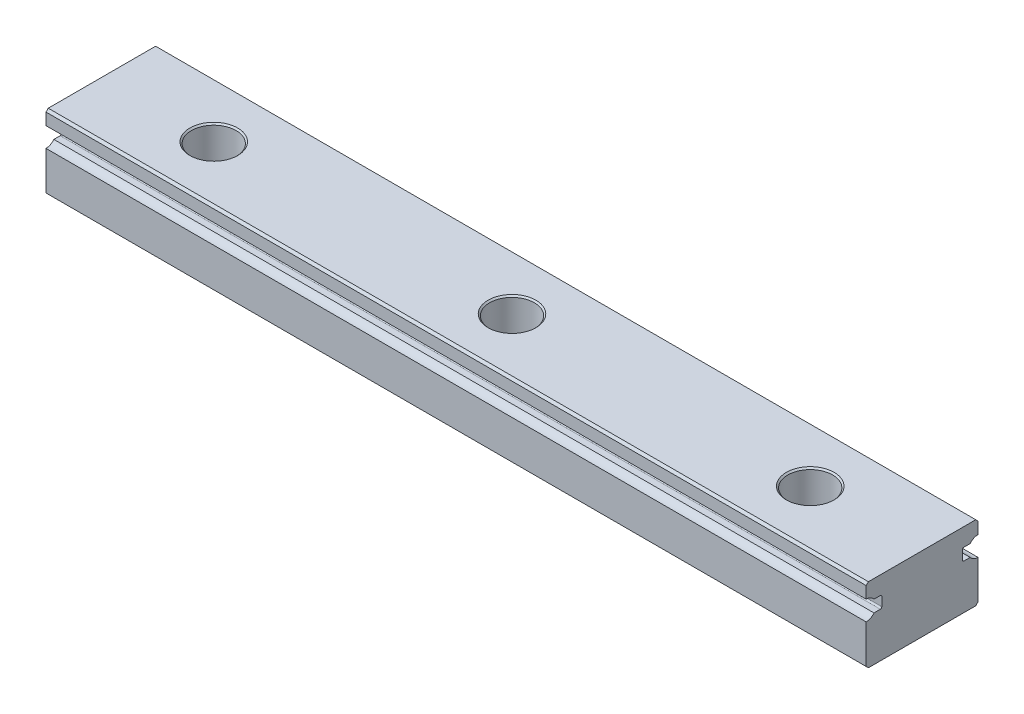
ISO-10303-21;
HEADER;
FILE_DESCRIPTION(('STEP AP214'),'2;1');
FILE_NAME('part.step','',(''),(''),'','','');
FILE_SCHEMA(('AUTOMOTIVE_DESIGN { 1 0 10303 214 1 1 1 1 }'));
ENDSEC;
DATA;
#1=APPLICATION_CONTEXT('core data for automotive mechanical design processes');
#2=APPLICATION_PROTOCOL_DEFINITION('international standard','automotive_design',2000,#1);
#3=PRODUCT_CONTEXT('',#1,'mechanical');
#4=PRODUCT('Part','Part','',(#3));
#5=PRODUCT_RELATED_PRODUCT_CATEGORY('part','',(#4));
#6=PRODUCT_DEFINITION_FORMATION('','',#4);
#7=PRODUCT_DEFINITION_CONTEXT('part definition',#1,'design');
#8=PRODUCT_DEFINITION('design','',#6,#7);
#9=PRODUCT_DEFINITION_SHAPE('','',#8);
#10=(LENGTH_UNIT() NAMED_UNIT(*) SI_UNIT(.MILLI.,.METRE.));
#11=(NAMED_UNIT(*) PLANE_ANGLE_UNIT() SI_UNIT($,.RADIAN.));
#12=(NAMED_UNIT(*) SI_UNIT($,.STERADIAN.) SOLID_ANGLE_UNIT());
#13=UNCERTAINTY_MEASURE_WITH_UNIT(LENGTH_MEASURE(1.E-05),#10,'distance_accuracy_value','');
#14=(GEOMETRIC_REPRESENTATION_CONTEXT(3) GLOBAL_UNCERTAINTY_ASSIGNED_CONTEXT((#13)) GLOBAL_UNIT_ASSIGNED_CONTEXT((#10,
#11,#12)) REPRESENTATION_CONTEXT('',''));
#15=CARTESIAN_POINT('',(0.,0.,0.));
#16=DIRECTION('',(0.,0.,1.));
#17=DIRECTION('',(1.,0.,0.));
#18=AXIS2_PLACEMENT_3D('',#15,#16,#17);
#19=CARTESIAN_POINT('',(110.,10.,-7.2));
#20=DIRECTION('',(0.,-1.,0.));
#21=DIRECTION('',(0.,0.,-1.));
#22=AXIS2_PLACEMENT_3D('',#19,#20,#21);
#23=PLANE('',#22);
#24=DIRECTION('',(0.,0.,1.));
#25=VECTOR('',#24,1.);
#26=CARTESIAN_POINT('',(0.,10.,-7.2));
#27=LINE('',#26,#25);
#28=CARTESIAN_POINT('',(0.,10.,-7.2));
#29=VERTEX_POINT('',#28);
#30=CARTESIAN_POINT('',(0.,10.,7.2));
#31=VERTEX_POINT('',#30);
#32=EDGE_CURVE('E11',#29,#31,#27,.T.);
#33=ORIENTED_EDGE('',*,*,#32,.T.);
#34=DIRECTION('',(-1.,0.,0.));
#35=VECTOR('',#34,1.);
#36=CARTESIAN_POINT('',(110.,10.,7.2));
#37=LINE('',#36,#35);
#38=CARTESIAN_POINT('',(110.,10.,7.2));
#39=VERTEX_POINT('',#38);
#40=EDGE_CURVE('E42',#39,#31,#37,.T.);
#41=ORIENTED_EDGE('',*,*,#40,.F.);
#42=DIRECTION('',(0.,0.,1.));
#43=VECTOR('',#42,1.);
#44=CARTESIAN_POINT('',(110.,10.,-7.2));
#45=LINE('',#44,#43);
#46=CARTESIAN_POINT('',(110.,10.,-7.2));
#47=VERTEX_POINT('',#46);
#48=EDGE_CURVE('E398',#47,#39,#45,.T.);
#49=ORIENTED_EDGE('',*,*,#48,.F.);
#50=DIRECTION('',(-1.,0.,0.));
#51=VECTOR('',#50,1.);
#52=CARTESIAN_POINT('',(110.,10.,-7.2));
#53=LINE('',#52,#51);
#54=EDGE_CURVE('E28',#47,#29,#53,.T.);
#55=ORIENTED_EDGE('',*,*,#54,.T.);
#56=EDGE_LOOP('',(#33,#41,#49,#55));
#57=FACE_BOUND('',#56,.T.);
#58=CARTESIAN_POINT('',(15.,10.,0.));
#59=DIRECTION('',(0.,-1.,0.));
#60=DIRECTION('',(0.,0.,-1.));
#61=AXIS2_PLACEMENT_3D('',#58,#59,#60);
#62=CIRCLE('',#61,3.205);
#63=CARTESIAN_POINT('',(15.,10.,-3.205));
#64=VERTEX_POINT('',#63);
#65=EDGE_CURVE('E489',#64,#64,#62,.T.);
#66=ORIENTED_EDGE('',*,*,#65,.T.);
#67=EDGE_LOOP('',(#66));
#68=FACE_BOUND('',#67,.T.);
#69=CARTESIAN_POINT('',(95.,10.,0.));
#70=DIRECTION('',(0.,-1.,0.));
#71=DIRECTION('',(0.,0.,-1.));
#72=AXIS2_PLACEMENT_3D('',#69,#70,#71);
#73=CIRCLE('',#72,3.205);
#74=CARTESIAN_POINT('',(95.,10.,-3.205));
#75=VERTEX_POINT('',#74);
#76=EDGE_CURVE('E458',#75,#75,#73,.T.);
#77=ORIENTED_EDGE('',*,*,#76,.T.);
#78=EDGE_LOOP('',(#77));
#79=FACE_BOUND('',#78,.T.);
#80=CARTESIAN_POINT('',(55.,10.,0.));
#81=DIRECTION('',(0.,-1.,0.));
#82=DIRECTION('',(0.,0.,-1.));
#83=AXIS2_PLACEMENT_3D('',#80,#81,#82);
#84=CIRCLE('',#83,3.205);
#85=CARTESIAN_POINT('',(55.,10.,-3.205));
#86=VERTEX_POINT('',#85);
#87=EDGE_CURVE('E352',#86,#86,#84,.T.);
#88=ORIENTED_EDGE('',*,*,#87,.T.);
#89=EDGE_LOOP('',(#88));
#90=FACE_BOUND('',#89,.T.);
#91=ADVANCED_FACE('F17',(#57,#68,#79,#90),#23,.F.);
#92=CARTESIAN_POINT('',(110.,6.8,7.5));
#93=DIRECTION('',(1.,0.,0.));
#94=DIRECTION('',(0.,1.,0.));
#95=AXIS2_PLACEMENT_3D('',#92,#93,#94);
#96=PLANE('',#95);
#97=DIRECTION('',(0.,-0.707106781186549,0.707106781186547));
#98=VECTOR('',#97,1.);
#99=CARTESIAN_POINT('',(110.,10.,7.2));
#100=LINE('',#99,#98);
#101=CARTESIAN_POINT('',(110.,9.7,7.5));
#102=VERTEX_POINT('',#101);
#103=EDGE_CURVE('E348',#39,#102,#100,.T.);
#104=ORIENTED_EDGE('',*,*,#103,.T.);
#105=DIRECTION('',(0.,-1.,0.));
#106=VECTOR('',#105,1.);
#107=CARTESIAN_POINT('',(110.,9.7,7.5));
#108=LINE('',#107,#106);
#109=CARTESIAN_POINT('',(110.,8.12003787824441,7.5));
#110=VERTEX_POINT('',#109);
#111=EDGE_CURVE('E353',#102,#110,#108,.T.);
#112=ORIENTED_EDGE('',*,*,#111,.T.);
#113=CARTESIAN_POINT('',(110.,6.8,7.5));
#114=DIRECTION('',(1.,0.,0.));
#115=DIRECTION('',(0.,0.,-1.));
#116=AXIS2_PLACEMENT_3D('',#113,#114,#115);
#117=CIRCLE('',#116,1.3200378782);
#118=CARTESIAN_POINT('',(110.,7.6,6.45));
#119=VERTEX_POINT('',#118);
#120=EDGE_CURVE('E451',#119,#110,#117,.T.);
#121=ORIENTED_EDGE('',*,*,#120,.F.);
#122=DIRECTION('',(0.,0.,-1.));
#123=VECTOR('',#122,1.);
#124=CARTESIAN_POINT('',(110.,7.6,6.45));
#125=LINE('',#124,#123);
#126=CARTESIAN_POINT('',(110.,7.6,5.6));
#127=VERTEX_POINT('',#126);
#128=EDGE_CURVE('E406',#119,#127,#125,.T.);
#129=ORIENTED_EDGE('',*,*,#128,.T.);
#130=CARTESIAN_POINT('',(110.,7.4,5.6));
#131=DIRECTION('',(1.,0.,0.));
#132=DIRECTION('',(0.,0.,-1.));
#133=AXIS2_PLACEMENT_3D('',#130,#131,#132);
#134=CIRCLE('',#133,0.2);
#135=CARTESIAN_POINT('',(110.,7.4,5.4));
#136=VERTEX_POINT('',#135);
#137=EDGE_CURVE('E181',#136,#127,#134,.T.);
#138=ORIENTED_EDGE('',*,*,#137,.F.);
#139=DIRECTION('',(0.,-1.,0.));
#140=VECTOR('',#139,1.);
#141=CARTESIAN_POINT('',(110.,7.4,5.4));
#142=LINE('',#141,#140);
#143=CARTESIAN_POINT('',(110.,6.2,5.4));
#144=VERTEX_POINT('',#143);
#145=EDGE_CURVE('E506',#136,#144,#142,.T.);
#146=ORIENTED_EDGE('',*,*,#145,.T.);
#147=CARTESIAN_POINT('',(110.,6.2,5.6));
#148=DIRECTION('',(1.,0.,0.));
#149=DIRECTION('',(0.,0.,-1.));
#150=AXIS2_PLACEMENT_3D('',#147,#148,#149);
#151=CIRCLE('',#150,0.2);
#152=CARTESIAN_POINT('',(110.,6.,5.6));
#153=VERTEX_POINT('',#152);
#154=EDGE_CURVE('E171',#153,#144,#151,.T.);
#155=ORIENTED_EDGE('',*,*,#154,.F.);
#156=DIRECTION('',(0.,0.,1.));
#157=VECTOR('',#156,1.);
#158=CARTESIAN_POINT('',(110.,6.,5.6));
#159=LINE('',#158,#157);
#160=CARTESIAN_POINT('',(110.,6.,6.45));
#161=VERTEX_POINT('',#160);
#162=EDGE_CURVE('E376',#153,#161,#159,.T.);
#163=ORIENTED_EDGE('',*,*,#162,.T.);
#164=CARTESIAN_POINT('',(110.,6.8,7.5));
#165=DIRECTION('',(1.,0.,0.));
#166=DIRECTION('',(0.,0.,-1.));
#167=AXIS2_PLACEMENT_3D('',#164,#165,#166);
#168=CIRCLE('',#167,1.3200378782);
#169=CARTESIAN_POINT('',(110.,5.47996212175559,7.5));
#170=VERTEX_POINT('',#169);
#171=EDGE_CURVE('E505',#170,#161,#168,.T.);
#172=ORIENTED_EDGE('',*,*,#171,.F.);
#173=DIRECTION('',(0.,-1.,0.));
#174=VECTOR('',#173,1.);
#175=CARTESIAN_POINT('',(110.,5.47996212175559,7.5));
#176=LINE('',#175,#174);
#177=CARTESIAN_POINT('',(110.,0.3,7.5));
#178=VERTEX_POINT('',#177);
#179=EDGE_CURVE('E372',#170,#178,#176,.T.);
#180=ORIENTED_EDGE('',*,*,#179,.T.);
#181=DIRECTION('',(0.,-0.707106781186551,-0.707106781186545));
#182=VECTOR('',#181,1.);
#183=CARTESIAN_POINT('',(110.,0.3,7.5));
#184=LINE('',#183,#182);
#185=CARTESIAN_POINT('',(110.,0.,7.2));
#186=VERTEX_POINT('',#185);
#187=EDGE_CURVE('E377',#178,#186,#184,.T.);
#188=ORIENTED_EDGE('',*,*,#187,.T.);
#189=DIRECTION('',(0.,0.,-1.));
#190=VECTOR('',#189,1.);
#191=CARTESIAN_POINT('',(110.,0.,7.2));
#192=LINE('',#191,#190);
#193=CARTESIAN_POINT('',(110.,0.,-7.2));
#194=VERTEX_POINT('',#193);
#195=EDGE_CURVE('E462',#186,#194,#192,.T.);
#196=ORIENTED_EDGE('',*,*,#195,.T.);
#197=DIRECTION('',(0.,0.707106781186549,-0.707106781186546));
#198=VECTOR('',#197,1.);
#199=CARTESIAN_POINT('',(110.,0.,-7.2));
#200=LINE('',#199,#198);
#201=CARTESIAN_POINT('',(110.,0.3,-7.5));
#202=VERTEX_POINT('',#201);
#203=EDGE_CURVE('E449',#194,#202,#200,.T.);
#204=ORIENTED_EDGE('',*,*,#203,.T.);
#205=DIRECTION('',(0.,1.,0.));
#206=VECTOR('',#205,1.);
#207=CARTESIAN_POINT('',(110.,0.3,-7.5));
#208=LINE('',#207,#206);
#209=CARTESIAN_POINT('',(110.,5.47996212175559,-7.5));
#210=VERTEX_POINT('',#209);
#211=EDGE_CURVE('E445',#202,#210,#208,.T.);
#212=ORIENTED_EDGE('',*,*,#211,.T.);
#213=CARTESIAN_POINT('',(110.,6.8,-7.5));
#214=DIRECTION('',(1.,0.,0.));
#215=DIRECTION('',(0.,0.,-1.));
#216=AXIS2_PLACEMENT_3D('',#213,#214,#215);
#217=CIRCLE('',#216,1.3200378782);
#218=CARTESIAN_POINT('',(110.,6.,-6.45));
#219=VERTEX_POINT('',#218);
#220=EDGE_CURVE('E499',#219,#210,#217,.T.);
#221=ORIENTED_EDGE('',*,*,#220,.F.);
#222=DIRECTION('',(0.,0.,1.));
#223=VECTOR('',#222,1.);
#224=CARTESIAN_POINT('',(110.,6.,-6.45));
#225=LINE('',#224,#223);
#226=CARTESIAN_POINT('',(110.,6.,-5.6));
#227=VERTEX_POINT('',#226);
#228=EDGE_CURVE('E450',#219,#227,#225,.T.);
#229=ORIENTED_EDGE('',*,*,#228,.T.);
#230=CARTESIAN_POINT('',(110.,6.2,-5.6));
#231=DIRECTION('',(1.,0.,0.));
#232=DIRECTION('',(0.,0.,-1.));
#233=AXIS2_PLACEMENT_3D('',#230,#231,#232);
#234=CIRCLE('',#233,0.2);
#235=CARTESIAN_POINT('',(110.,6.2,-5.4));
#236=VERTEX_POINT('',#235);
#237=EDGE_CURVE('E380',#236,#227,#234,.T.);
#238=ORIENTED_EDGE('',*,*,#237,.F.);
#239=DIRECTION('',(0.,1.,0.));
#240=VECTOR('',#239,1.);
#241=CARTESIAN_POINT('',(110.,6.2,-5.4));
#242=LINE('',#241,#240);
#243=CARTESIAN_POINT('',(110.,7.4,-5.4));
#244=VERTEX_POINT('',#243);
#245=EDGE_CURVE('E357',#236,#244,#242,.T.);
#246=ORIENTED_EDGE('',*,*,#245,.T.);
#247=CARTESIAN_POINT('',(110.,7.4,-5.6));
#248=DIRECTION('',(1.,0.,0.));
#249=DIRECTION('',(0.,0.,-1.));
#250=AXIS2_PLACEMENT_3D('',#247,#248,#249);
#251=CIRCLE('',#250,0.2);
#252=CARTESIAN_POINT('',(110.,7.6,-5.6));
#253=VERTEX_POINT('',#252);
#254=EDGE_CURVE('E490',#253,#244,#251,.T.);
#255=ORIENTED_EDGE('',*,*,#254,.F.);
#256=DIRECTION('',(0.,0.,-1.));
#257=VECTOR('',#256,1.);
#258=CARTESIAN_POINT('',(110.,7.6,-5.6));
#259=LINE('',#258,#257);
#260=CARTESIAN_POINT('',(110.,7.6,-6.45));
#261=VERTEX_POINT('',#260);
#262=EDGE_CURVE('E346',#253,#261,#259,.T.);
#263=ORIENTED_EDGE('',*,*,#262,.T.);
#264=CARTESIAN_POINT('',(110.,6.8,-7.5));
#265=DIRECTION('',(1.,0.,0.));
#266=DIRECTION('',(0.,0.,-1.));
#267=AXIS2_PLACEMENT_3D('',#264,#265,#266);
#268=CIRCLE('',#267,1.3200378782);
#269=CARTESIAN_POINT('',(110.,8.12003787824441,-7.5));
#270=VERTEX_POINT('',#269);
#271=EDGE_CURVE('E358',#270,#261,#268,.T.);
#272=ORIENTED_EDGE('',*,*,#271,.F.);
#273=DIRECTION('',(0.,1.,0.));
#274=VECTOR('',#273,1.);
#275=CARTESIAN_POINT('',(110.,8.12003787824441,-7.5));
#276=LINE('',#275,#274);
#277=CARTESIAN_POINT('',(110.,9.7,-7.5));
#278=VERTEX_POINT('',#277);
#279=EDGE_CURVE('E342',#270,#278,#276,.T.);
#280=ORIENTED_EDGE('',*,*,#279,.T.);
#281=DIRECTION('',(0.,0.707106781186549,0.707106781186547));
#282=VECTOR('',#281,1.);
#283=CARTESIAN_POINT('',(110.,9.7,-7.5));
#284=LINE('',#283,#282);
#285=EDGE_CURVE('E347',#278,#47,#284,.T.);
#286=ORIENTED_EDGE('',*,*,#285,.T.);
#287=ORIENTED_EDGE('',*,*,#48,.T.);
#288=EDGE_LOOP('',(#104,#112,#121,#129,#138,#146,#155,#163,#172,#180,#188,#196,#204,#212,#221,
#229,#238,#246,#255,#263,#272,#280,#286,#287));
#289=FACE_BOUND('',#288,.T.);
#290=ADVANCED_FACE('F563',(#289),#96,.T.);
#291=CARTESIAN_POINT('',(110.,9.7,-7.5));
#292=DIRECTION('',(0.,-0.707106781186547,0.707106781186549));
#293=DIRECTION('',(-1.,0.,0.));
#294=AXIS2_PLACEMENT_3D('',#291,#292,#293);
#295=PLANE('',#294);
#296=DIRECTION('',(0.,0.707106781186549,0.707106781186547));
#297=VECTOR('',#296,1.);
#298=CARTESIAN_POINT('',(0.,9.7,-7.5));
#299=LINE('',#298,#297);
#300=CARTESIAN_POINT('',(0.,9.7,-7.5));
#301=VERTEX_POINT('',#300);
#302=EDGE_CURVE('E402',#301,#29,#299,.T.);
#303=ORIENTED_EDGE('',*,*,#302,.T.);
#304=ORIENTED_EDGE('',*,*,#54,.F.);
#305=ORIENTED_EDGE('',*,*,#285,.F.);
#306=DIRECTION('',(-1.,0.,0.));
#307=VECTOR('',#306,1.);
#308=CARTESIAN_POINT('',(110.,9.7,-7.5));
#309=LINE('',#308,#307);
#310=EDGE_CURVE('E366',#278,#301,#309,.T.);
#311=ORIENTED_EDGE('',*,*,#310,.T.);
#312=EDGE_LOOP('',(#303,#304,#305,#311));
#313=FACE_BOUND('',#312,.T.);
#314=ADVANCED_FACE('F570',(#313),#295,.F.);
#315=CARTESIAN_POINT('',(110.,10.,7.2));
#316=DIRECTION('',(0.,-0.707106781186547,-0.707106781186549));
#317=DIRECTION('',(0.,-0.707106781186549,0.707106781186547));
#318=AXIS2_PLACEMENT_3D('',#315,#316,#317);
#319=PLANE('',#318);
#320=DIRECTION('',(0.,-0.707106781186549,0.707106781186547));
#321=VECTOR('',#320,1.);
#322=CARTESIAN_POINT('',(0.,10.,7.2));
#323=LINE('',#322,#321);
#324=CARTESIAN_POINT('',(0.,9.7,7.5));
#325=VERTEX_POINT('',#324);
#326=EDGE_CURVE('E363',#31,#325,#323,.T.);
#327=ORIENTED_EDGE('',*,*,#326,.T.);
#328=DIRECTION('',(-1.,0.,0.));
#329=VECTOR('',#328,1.);
#330=CARTESIAN_POINT('',(110.,9.7,7.5));
#331=LINE('',#330,#329);
#332=EDGE_CURVE('E435',#102,#325,#331,.T.);
#333=ORIENTED_EDGE('',*,*,#332,.F.);
#334=ORIENTED_EDGE('',*,*,#103,.F.);
#335=ORIENTED_EDGE('',*,*,#40,.T.);
#336=EDGE_LOOP('',(#327,#333,#334,#335));
#337=FACE_BOUND('',#336,.T.);
#338=ADVANCED_FACE('F605',(#337),#319,.F.);
#339=CARTESIAN_POINT('',(110.,9.7,7.5));
#340=DIRECTION('',(0.,0.,-1.));
#341=DIRECTION('',(0.,-1.,0.));
#342=AXIS2_PLACEMENT_3D('',#339,#340,#341);
#343=PLANE('',#342);
#344=DIRECTION('',(0.,-1.,0.));
#345=VECTOR('',#344,1.);
#346=CARTESIAN_POINT('',(0.,9.7,7.5));
#347=LINE('',#346,#345);
#348=CARTESIAN_POINT('',(0.,8.12003787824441,7.5));
#349=VERTEX_POINT('',#348);
#350=EDGE_CURVE('E431',#325,#349,#347,.T.);
#351=ORIENTED_EDGE('',*,*,#350,.T.);
#352=DIRECTION('',(-1.,0.,0.));
#353=VECTOR('',#352,1.);
#354=CARTESIAN_POINT('',(110.,8.12003787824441,7.5));
#355=LINE('',#354,#353);
#356=EDGE_CURVE('E454',#110,#349,#355,.T.);
#357=ORIENTED_EDGE('',*,*,#356,.F.);
#358=ORIENTED_EDGE('',*,*,#111,.F.);
#359=ORIENTED_EDGE('',*,*,#332,.T.);
#360=EDGE_LOOP('',(#351,#357,#358,#359));
#361=FACE_BOUND('',#360,.T.);
#362=ADVANCED_FACE('F603',(#361),#343,.F.);
#363=CARTESIAN_POINT('',(110.,6.8,7.5));
#364=DIRECTION('',(1.,0.,0.));
#365=DIRECTION('',(0.,0.,1.));
#366=AXIS2_PLACEMENT_3D('',#363,#364,#365);
#367=CYLINDRICAL_SURFACE('',#366,1.3200378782);
#368=CARTESIAN_POINT('',(0.,6.8,7.5));
#369=DIRECTION('',(1.,0.,0.));
#370=DIRECTION('',(0.,0.,-1.));
#371=AXIS2_PLACEMENT_3D('',#368,#369,#370);
#372=CIRCLE('',#371,1.3200378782);
#373=CARTESIAN_POINT('',(0.,7.6,6.45));
#374=VERTEX_POINT('',#373);
#375=EDGE_CURVE('E430',#374,#349,#372,.T.);
#376=ORIENTED_EDGE('',*,*,#375,.F.);
#377=DIRECTION('',(-1.,0.,0.));
#378=VECTOR('',#377,1.);
#379=CARTESIAN_POINT('',(110.,7.6,6.45));
#380=LINE('',#379,#378);
#381=EDGE_CURVE('E367',#119,#374,#380,.T.);
#382=ORIENTED_EDGE('',*,*,#381,.F.);
#383=ORIENTED_EDGE('',*,*,#120,.T.);
#384=ORIENTED_EDGE('',*,*,#356,.T.);
#385=EDGE_LOOP('',(#376,#382,#383,#384));
#386=FACE_BOUND('',#385,.T.);
#387=ADVANCED_FACE('F599',(#386),#367,.F.);
#388=CARTESIAN_POINT('',(110.,7.6,6.45));
#389=DIRECTION('',(0.,1.,0.));
#390=DIRECTION('',(1.,0.,0.));
#391=AXIS2_PLACEMENT_3D('',#388,#389,#390);
#392=PLANE('',#391);
#393=DIRECTION('',(0.,0.,-1.));
#394=VECTOR('',#393,1.);
#395=CARTESIAN_POINT('',(0.,7.6,6.45));
#396=LINE('',#395,#394);
#397=CARTESIAN_POINT('',(0.,7.6,5.6));
#398=VERTEX_POINT('',#397);
#399=EDGE_CURVE('E371',#374,#398,#396,.T.);
#400=ORIENTED_EDGE('',*,*,#399,.T.);
#401=DIRECTION('',(-1.,0.,0.));
#402=VECTOR('',#401,1.);
#403=CARTESIAN_POINT('',(110.,7.6,5.6));
#404=LINE('',#403,#402);
#405=EDGE_CURVE('E394',#127,#398,#404,.T.);
#406=ORIENTED_EDGE('',*,*,#405,.F.);
#407=ORIENTED_EDGE('',*,*,#128,.F.);
#408=ORIENTED_EDGE('',*,*,#381,.T.);
#409=EDGE_LOOP('',(#400,#406,#407,#408));
#410=FACE_BOUND('',#409,.T.);
#411=ADVANCED_FACE('F602',(#410),#392,.F.);
#412=CARTESIAN_POINT('',(110.,7.4,5.6));
#413=DIRECTION('',(1.,0.,0.));
#414=DIRECTION('',(0.,0.,1.));
#415=AXIS2_PLACEMENT_3D('',#412,#413,#414);
#416=CYLINDRICAL_SURFACE('',#415,0.2);
#417=CARTESIAN_POINT('',(0.,7.4,5.6));
#418=DIRECTION('',(1.,0.,0.));
#419=DIRECTION('',(0.,0.,-1.));
#420=AXIS2_PLACEMENT_3D('',#417,#418,#419);
#421=CIRCLE('',#420,0.2);
#422=CARTESIAN_POINT('',(0.,7.4,5.4));
#423=VERTEX_POINT('',#422);
#424=EDGE_CURVE('E426',#423,#398,#421,.T.);
#425=ORIENTED_EDGE('',*,*,#424,.F.);
#426=DIRECTION('',(-1.,0.,0.));
#427=VECTOR('',#426,1.);
#428=CARTESIAN_POINT('',(110.,7.4,5.4));
#429=LINE('',#428,#427);
#430=EDGE_CURVE('E310',#136,#423,#429,.T.);
#431=ORIENTED_EDGE('',*,*,#430,.F.);
#432=ORIENTED_EDGE('',*,*,#137,.T.);
#433=ORIENTED_EDGE('',*,*,#405,.T.);
#434=EDGE_LOOP('',(#425,#431,#432,#433));
#435=FACE_BOUND('',#434,.T.);
#436=ADVANCED_FACE('F638',(#435),#416,.F.);
#437=CARTESIAN_POINT('',(110.,7.4,5.4));
#438=DIRECTION('',(0.,0.,-1.));
#439=DIRECTION('',(0.,-1.,0.));
#440=AXIS2_PLACEMENT_3D('',#437,#438,#439);
#441=PLANE('',#440);
#442=DIRECTION('',(0.,-1.,0.));
#443=VECTOR('',#442,1.);
#444=CARTESIAN_POINT('',(0.,7.4,5.4));
#445=LINE('',#444,#443);
#446=CARTESIAN_POINT('',(0.,6.2,5.4));
#447=VERTEX_POINT('',#446);
#448=EDGE_CURVE('E390',#423,#447,#445,.T.);
#449=ORIENTED_EDGE('',*,*,#448,.T.);
#450=DIRECTION('',(-1.,0.,0.));
#451=VECTOR('',#450,1.);
#452=CARTESIAN_POINT('',(110.,6.2,5.4));
#453=LINE('',#452,#451);
#454=EDGE_CURVE('E311',#144,#447,#453,.T.);
#455=ORIENTED_EDGE('',*,*,#454,.F.);
#456=ORIENTED_EDGE('',*,*,#145,.F.);
#457=ORIENTED_EDGE('',*,*,#430,.T.);
#458=EDGE_LOOP('',(#449,#455,#456,#457));
#459=FACE_BOUND('',#458,.T.);
#460=ADVANCED_FACE('F644',(#459),#441,.F.);
#461=CARTESIAN_POINT('',(110.,6.2,5.6));
#462=DIRECTION('',(1.,0.,0.));
#463=DIRECTION('',(0.,0.,1.));
#464=AXIS2_PLACEMENT_3D('',#461,#462,#463);
#465=CYLINDRICAL_SURFACE('',#464,0.2);
#466=CARTESIAN_POINT('',(0.,6.2,5.6));
#467=DIRECTION('',(1.,0.,0.));
#468=DIRECTION('',(0.,0.,-1.));
#469=AXIS2_PLACEMENT_3D('',#466,#467,#468);
#470=CIRCLE('',#469,0.2);
#471=CARTESIAN_POINT('',(0.,6.,5.6));
#472=VERTEX_POINT('',#471);
#473=EDGE_CURVE('E329',#472,#447,#470,.T.);
#474=ORIENTED_EDGE('',*,*,#473,.F.);
#475=DIRECTION('',(-1.,0.,0.));
#476=VECTOR('',#475,1.);
#477=CARTESIAN_POINT('',(110.,6.,5.6));
#478=LINE('',#477,#476);
#479=EDGE_CURVE('E475',#153,#472,#478,.T.);
#480=ORIENTED_EDGE('',*,*,#479,.F.);
#481=ORIENTED_EDGE('',*,*,#154,.T.);
#482=ORIENTED_EDGE('',*,*,#454,.T.);
#483=EDGE_LOOP('',(#474,#480,#481,#482));
#484=FACE_BOUND('',#483,.T.);
#485=ADVANCED_FACE('F612',(#484),#465,.F.);
#486=CARTESIAN_POINT('',(110.,6.,5.6));
#487=DIRECTION('',(0.,-1.,0.));
#488=DIRECTION('',(0.,0.,-1.));
#489=AXIS2_PLACEMENT_3D('',#486,#487,#488);
#490=PLANE('',#489);
#491=DIRECTION('',(0.,0.,1.));
#492=VECTOR('',#491,1.);
#493=CARTESIAN_POINT('',(0.,6.,5.6));
#494=LINE('',#493,#492);
#495=CARTESIAN_POINT('',(0.,6.,6.45));
#496=VERTEX_POINT('',#495);
#497=EDGE_CURVE('E471',#472,#496,#494,.T.);
#498=ORIENTED_EDGE('',*,*,#497,.T.);
#499=DIRECTION('',(-1.,0.,0.));
#500=VECTOR('',#499,1.);
#501=CARTESIAN_POINT('',(110.,6.,6.45));
#502=LINE('',#501,#500);
#503=EDGE_CURVE('E413',#161,#496,#502,.T.);
#504=ORIENTED_EDGE('',*,*,#503,.F.);
#505=ORIENTED_EDGE('',*,*,#162,.F.);
#506=ORIENTED_EDGE('',*,*,#479,.T.);
#507=EDGE_LOOP('',(#498,#504,#505,#506));
#508=FACE_BOUND('',#507,.T.);
#509=ADVANCED_FACE('F608',(#508),#490,.F.);
#510=CARTESIAN_POINT('',(110.,6.8,7.5));
#511=DIRECTION('',(1.,0.,0.));
#512=DIRECTION('',(0.,0.,1.));
#513=AXIS2_PLACEMENT_3D('',#510,#511,#512);
#514=CYLINDRICAL_SURFACE('',#513,1.3200378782);
#515=CARTESIAN_POINT('',(0.,6.8,7.5));
#516=DIRECTION('',(1.,0.,0.));
#517=DIRECTION('',(0.,0.,-1.));
#518=AXIS2_PLACEMENT_3D('',#515,#516,#517);
#519=CIRCLE('',#518,1.3200378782);
#520=CARTESIAN_POINT('',(0.,5.47996212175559,7.5));
#521=VERTEX_POINT('',#520);
#522=EDGE_CURVE('E324',#521,#496,#519,.T.);
#523=ORIENTED_EDGE('',*,*,#522,.F.);
#524=DIRECTION('',(-1.,0.,0.));
#525=VECTOR('',#524,1.);
#526=CARTESIAN_POINT('',(110.,5.47996212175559,7.5));
#527=LINE('',#526,#525);
#528=EDGE_CURVE('E330',#170,#521,#527,.T.);
#529=ORIENTED_EDGE('',*,*,#528,.F.);
#530=ORIENTED_EDGE('',*,*,#171,.T.);
#531=ORIENTED_EDGE('',*,*,#503,.T.);
#532=EDGE_LOOP('',(#523,#529,#530,#531));
#533=FACE_BOUND('',#532,.T.);
#534=ADVANCED_FACE('F611',(#533),#514,.F.);
#535=CARTESIAN_POINT('',(110.,5.47996212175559,7.5));
#536=DIRECTION('',(0.,0.,-1.));
#537=DIRECTION('',(0.,-1.,0.));
#538=AXIS2_PLACEMENT_3D('',#535,#536,#537);
#539=PLANE('',#538);
#540=DIRECTION('',(0.,-1.,0.));
#541=VECTOR('',#540,1.);
#542=CARTESIAN_POINT('',(0.,5.47996212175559,7.5));
#543=LINE('',#542,#541);
#544=CARTESIAN_POINT('',(0.,0.3,7.5));
#545=VERTEX_POINT('',#544);
#546=EDGE_CURVE('E334',#521,#545,#543,.T.);
#547=ORIENTED_EDGE('',*,*,#546,.T.);
#548=DIRECTION('',(-1.,0.,0.));
#549=VECTOR('',#548,1.);
#550=CARTESIAN_POINT('',(110.,0.3,7.5));
#551=LINE('',#550,#549);
#552=EDGE_CURVE('E389',#178,#545,#551,.T.);
#553=ORIENTED_EDGE('',*,*,#552,.F.);
#554=ORIENTED_EDGE('',*,*,#179,.F.);
#555=ORIENTED_EDGE('',*,*,#528,.T.);
#556=EDGE_LOOP('',(#547,#553,#554,#555));
#557=FACE_BOUND('',#556,.T.);
#558=ADVANCED_FACE('F619',(#557),#539,.F.);
#559=CARTESIAN_POINT('',(110.,0.3,7.5));
#560=DIRECTION('',(0.,0.707106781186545,-0.70710678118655));
#561=DIRECTION('',(-1.,0.,0.));
#562=AXIS2_PLACEMENT_3D('',#559,#560,#561);
#563=PLANE('',#562);
#564=DIRECTION('',(0.,-0.707106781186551,-0.707106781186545));
#565=VECTOR('',#564,1.);
#566=CARTESIAN_POINT('',(0.,0.3,7.5));
#567=LINE('',#566,#565);
#568=CARTESIAN_POINT('',(0.,0.,7.2));
#569=VERTEX_POINT('',#568);
#570=EDGE_CURVE('E335',#545,#569,#567,.T.);
#571=ORIENTED_EDGE('',*,*,#570,.T.);
#572=DIRECTION('',(-1.,0.,0.));
#573=VECTOR('',#572,1.);
#574=CARTESIAN_POINT('',(110.,0.,7.2));
#575=LINE('',#574,#573);
#576=EDGE_CURVE('E312',#186,#569,#575,.T.);
#577=ORIENTED_EDGE('',*,*,#576,.F.);
#578=ORIENTED_EDGE('',*,*,#187,.F.);
#579=ORIENTED_EDGE('',*,*,#552,.T.);
#580=EDGE_LOOP('',(#571,#577,#578,#579));
#581=FACE_BOUND('',#580,.T.);
#582=ADVANCED_FACE('F862',(#581),#563,.F.);
#583=CARTESIAN_POINT('',(110.,0.,7.2));
#584=DIRECTION('',(0.,1.,0.));
#585=DIRECTION('',(1.,0.,0.));
#586=AXIS2_PLACEMENT_3D('',#583,#584,#585);
#587=PLANE('',#586);
#588=DIRECTION('',(0.,0.,-1.));
#589=VECTOR('',#588,1.);
#590=CARTESIAN_POINT('',(0.,0.,7.2));
#591=LINE('',#590,#589);
#592=CARTESIAN_POINT('',(0.,0.,-7.2));
#593=VERTEX_POINT('',#592);
#594=EDGE_CURVE('E316',#569,#593,#591,.T.);
#595=ORIENTED_EDGE('',*,*,#594,.T.);
#596=DIRECTION('',(-1.,0.,0.));
#597=VECTOR('',#596,1.);
#598=CARTESIAN_POINT('',(110.,0.,-7.2));
#599=LINE('',#598,#597);
#600=EDGE_CURVE('E534',#194,#593,#599,.T.);
#601=ORIENTED_EDGE('',*,*,#600,.F.);
#602=ORIENTED_EDGE('',*,*,#195,.F.);
#603=ORIENTED_EDGE('',*,*,#576,.T.);
#604=EDGE_LOOP('',(#595,#601,#602,#603));
#605=FACE_BOUND('',#604,.T.);
#606=CARTESIAN_POINT('',(15.,0.,0.));
#607=DIRECTION('',(0.,-1.,0.));
#608=DIRECTION('',(0.,0.,-1.));
#609=AXIS2_PLACEMENT_3D('',#606,#607,#608);
#610=CIRCLE('',#609,1.955);
#611=CARTESIAN_POINT('',(15.,0.,-1.955));
#612=VERTEX_POINT('',#611);
#613=EDGE_CURVE('E523',#612,#612,#610,.T.);
#614=ORIENTED_EDGE('',*,*,#613,.F.);
#615=EDGE_LOOP('',(#614));
#616=FACE_BOUND('',#615,.T.);
#617=CARTESIAN_POINT('',(95.,0.,0.));
#618=DIRECTION('',(0.,-1.,0.));
#619=DIRECTION('',(0.,0.,-1.));
#620=AXIS2_PLACEMENT_3D('',#617,#618,#619);
#621=CIRCLE('',#620,1.955);
#622=CARTESIAN_POINT('',(95.,0.,-1.955));
#623=VERTEX_POINT('',#622);
#624=EDGE_CURVE('E293',#623,#623,#621,.T.);
#625=ORIENTED_EDGE('',*,*,#624,.F.);
#626=EDGE_LOOP('',(#625));
#627=FACE_BOUND('',#626,.T.);
#628=CARTESIAN_POINT('',(55.,0.,0.));
#629=DIRECTION('',(0.,-1.,0.));
#630=DIRECTION('',(0.,0.,-1.));
#631=AXIS2_PLACEMENT_3D('',#628,#629,#630);
#632=CIRCLE('',#631,1.955);
#633=CARTESIAN_POINT('',(55.,0.,-1.955));
#634=VERTEX_POINT('',#633);
#635=EDGE_CURVE('E420',#634,#634,#632,.T.);
#636=ORIENTED_EDGE('',*,*,#635,.F.);
#637=EDGE_LOOP('',(#636));
#638=FACE_BOUND('',#637,.T.);
#639=ADVANCED_FACE('F834',(#605,#616,#627,#638),#587,.F.);
#640=CARTESIAN_POINT('',(110.,0.,-7.2));
#641=DIRECTION('',(0.,0.707106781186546,0.707106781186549));
#642=DIRECTION('',(1.,0.,0.));
#643=AXIS2_PLACEMENT_3D('',#640,#641,#642);
#644=PLANE('',#643);
#645=DIRECTION('',(0.,0.707106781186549,-0.707106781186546));
#646=VECTOR('',#645,1.);
#647=CARTESIAN_POINT('',(0.,0.,-7.2));
#648=LINE('',#647,#646);
#649=CARTESIAN_POINT('',(0.,0.3,-7.5));
#650=VERTEX_POINT('',#649);
#651=EDGE_CURVE('E317',#593,#650,#648,.T.);
#652=ORIENTED_EDGE('',*,*,#651,.T.);
#653=DIRECTION('',(-1.,0.,0.));
#654=VECTOR('',#653,1.);
#655=CARTESIAN_POINT('',(110.,0.3,-7.5));
#656=LINE('',#655,#654);
#657=EDGE_CURVE('E495',#202,#650,#656,.T.);
#658=ORIENTED_EDGE('',*,*,#657,.F.);
#659=ORIENTED_EDGE('',*,*,#203,.F.);
#660=ORIENTED_EDGE('',*,*,#600,.T.);
#661=EDGE_LOOP('',(#652,#658,#659,#660));
#662=FACE_BOUND('',#661,.T.);
#663=ADVANCED_FACE('F839',(#662),#644,.F.);
#664=CARTESIAN_POINT('',(110.,0.3,-7.5));
#665=DIRECTION('',(0.,0.,1.));
#666=DIRECTION('',(1.,0.,0.));
#667=AXIS2_PLACEMENT_3D('',#664,#665,#666);
#668=PLANE('',#667);
#669=DIRECTION('',(0.,1.,0.));
#670=VECTOR('',#669,1.);
#671=CARTESIAN_POINT('',(0.,0.3,-7.5));
#672=LINE('',#671,#670);
#673=CARTESIAN_POINT('',(0.,5.47996212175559,-7.5));
#674=VERTEX_POINT('',#673);
#675=EDGE_CURVE('E498',#650,#674,#672,.T.);
#676=ORIENTED_EDGE('',*,*,#675,.T.);
#677=DIRECTION('',(-1.,0.,0.));
#678=VECTOR('',#677,1.);
#679=CARTESIAN_POINT('',(110.,5.47996212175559,-7.5));
#680=LINE('',#679,#678);
#681=EDGE_CURVE('E440',#210,#674,#680,.T.);
#682=ORIENTED_EDGE('',*,*,#681,.F.);
#683=ORIENTED_EDGE('',*,*,#211,.F.);
#684=ORIENTED_EDGE('',*,*,#657,.T.);
#685=EDGE_LOOP('',(#676,#682,#683,#684));
#686=FACE_BOUND('',#685,.T.);
#687=ADVANCED_FACE('F837',(#686),#668,.F.);
#688=CARTESIAN_POINT('',(110.,6.8,-7.5));
#689=DIRECTION('',(1.,0.,0.));
#690=DIRECTION('',(0.,0.,1.));
#691=AXIS2_PLACEMENT_3D('',#688,#689,#690);
#692=CYLINDRICAL_SURFACE('',#691,1.3200378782);
#693=CARTESIAN_POINT('',(0.,6.8,-7.5));
#694=DIRECTION('',(1.,0.,0.));
#695=DIRECTION('',(0.,0.,-1.));
#696=AXIS2_PLACEMENT_3D('',#693,#694,#695);
#697=CIRCLE('',#696,1.3200378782);
#698=CARTESIAN_POINT('',(0.,6.,-6.45));
#699=VERTEX_POINT('',#698);
#700=EDGE_CURVE('E328',#699,#674,#697,.T.);
#701=ORIENTED_EDGE('',*,*,#700,.F.);
#702=DIRECTION('',(-1.,0.,0.));
#703=VECTOR('',#702,1.);
#704=CARTESIAN_POINT('',(110.,6.,-6.45));
#705=LINE('',#704,#703);
#706=EDGE_CURVE('E441',#219,#699,#705,.T.);
#707=ORIENTED_EDGE('',*,*,#706,.F.);
#708=ORIENTED_EDGE('',*,*,#220,.T.);
#709=ORIENTED_EDGE('',*,*,#681,.T.);
#710=EDGE_LOOP('',(#701,#707,#708,#709));
#711=FACE_BOUND('',#710,.T.);
#712=ADVANCED_FACE('F581',(#711),#692,.F.);
#713=CARTESIAN_POINT('',(110.,6.,-6.45));
#714=DIRECTION('',(0.,-1.,0.));
#715=DIRECTION('',(0.,0.,-1.));
#716=AXIS2_PLACEMENT_3D('',#713,#714,#715);
#717=PLANE('',#716);
#718=DIRECTION('',(0.,0.,1.));
#719=VECTOR('',#718,1.);
#720=CARTESIAN_POINT('',(0.,6.,-6.45));
#721=LINE('',#720,#719);
#722=CARTESIAN_POINT('',(0.,6.,-5.6));
#723=VERTEX_POINT('',#722);
#724=EDGE_CURVE('E436',#699,#723,#721,.T.);
#725=ORIENTED_EDGE('',*,*,#724,.T.);
#726=DIRECTION('',(-1.,0.,0.));
#727=VECTOR('',#726,1.);
#728=CARTESIAN_POINT('',(110.,6.,-5.6));
#729=LINE('',#728,#727);
#730=EDGE_CURVE('E378',#227,#723,#729,.T.);
#731=ORIENTED_EDGE('',*,*,#730,.F.);
#732=ORIENTED_EDGE('',*,*,#228,.F.);
#733=ORIENTED_EDGE('',*,*,#706,.T.);
#734=EDGE_LOOP('',(#725,#731,#732,#733));
#735=FACE_BOUND('',#734,.T.);
#736=ADVANCED_FACE('F577',(#735),#717,.F.);
#737=CARTESIAN_POINT('',(110.,6.2,-5.6));
#738=DIRECTION('',(1.,0.,0.));
#739=DIRECTION('',(0.,0.,1.));
#740=AXIS2_PLACEMENT_3D('',#737,#738,#739);
#741=CYLINDRICAL_SURFACE('',#740,0.2);
#742=CARTESIAN_POINT('',(0.,6.2,-5.6));
#743=DIRECTION('',(1.,0.,0.));
#744=DIRECTION('',(0.,0.,-1.));
#745=AXIS2_PLACEMENT_3D('',#742,#743,#744);
#746=CIRCLE('',#745,0.2);
#747=CARTESIAN_POINT('',(0.,6.2,-5.4));
#748=VERTEX_POINT('',#747);
#749=EDGE_CURVE('E323',#748,#723,#746,.T.);
#750=ORIENTED_EDGE('',*,*,#749,.F.);
#751=DIRECTION('',(-1.,0.,0.));
#752=VECTOR('',#751,1.);
#753=CARTESIAN_POINT('',(110.,6.2,-5.4));
#754=LINE('',#753,#752);
#755=EDGE_CURVE('E479',#236,#748,#754,.T.);
#756=ORIENTED_EDGE('',*,*,#755,.F.);
#757=ORIENTED_EDGE('',*,*,#237,.T.);
#758=ORIENTED_EDGE('',*,*,#730,.T.);
#759=EDGE_LOOP('',(#750,#756,#757,#758));
#760=FACE_BOUND('',#759,.T.);
#761=ADVANCED_FACE('F580',(#760),#741,.F.);
#762=CARTESIAN_POINT('',(110.,6.2,-5.4));
#763=DIRECTION('',(0.,0.,1.));
#764=DIRECTION('',(1.,0.,0.));
#765=AXIS2_PLACEMENT_3D('',#762,#763,#764);
#766=PLANE('',#765);
#767=DIRECTION('',(0.,1.,0.));
#768=VECTOR('',#767,1.);
#769=CARTESIAN_POINT('',(0.,6.2,-5.4));
#770=LINE('',#769,#768);
#771=CARTESIAN_POINT('',(0.,7.4,-5.4));
#772=VERTEX_POINT('',#771);
#773=EDGE_CURVE('E381',#748,#772,#770,.T.);
#774=ORIENTED_EDGE('',*,*,#773,.T.);
#775=DIRECTION('',(-1.,0.,0.));
#776=VECTOR('',#775,1.);
#777=CARTESIAN_POINT('',(110.,7.4,-5.4));
#778=LINE('',#777,#776);
#779=EDGE_CURVE('E494',#244,#772,#778,.T.);
#780=ORIENTED_EDGE('',*,*,#779,.F.);
#781=ORIENTED_EDGE('',*,*,#245,.F.);
#782=ORIENTED_EDGE('',*,*,#755,.T.);
#783=EDGE_LOOP('',(#774,#780,#781,#782));
#784=FACE_BOUND('',#783,.T.);
#785=ADVANCED_FACE('F597',(#784),#766,.F.);
#786=CARTESIAN_POINT('',(110.,7.4,-5.6));
#787=DIRECTION('',(1.,0.,0.));
#788=DIRECTION('',(0.,0.,1.));
#789=AXIS2_PLACEMENT_3D('',#786,#787,#788);
#790=CYLINDRICAL_SURFACE('',#789,0.2);
#791=CARTESIAN_POINT('',(0.,7.4,-5.6));
#792=DIRECTION('',(1.,0.,0.));
#793=DIRECTION('',(0.,0.,-1.));
#794=AXIS2_PLACEMENT_3D('',#791,#792,#793);
#795=CIRCLE('',#794,0.2);
#796=CARTESIAN_POINT('',(0.,7.6,-5.6));
#797=VERTEX_POINT('',#796);
#798=EDGE_CURVE('E318',#797,#772,#795,.T.);
#799=ORIENTED_EDGE('',*,*,#798,.F.);
#800=DIRECTION('',(-1.,0.,0.));
#801=VECTOR('',#800,1.);
#802=CARTESIAN_POINT('',(110.,7.6,-5.6));
#803=LINE('',#802,#801);
#804=EDGE_CURVE('E361',#253,#797,#803,.T.);
#805=ORIENTED_EDGE('',*,*,#804,.F.);
#806=ORIENTED_EDGE('',*,*,#254,.T.);
#807=ORIENTED_EDGE('',*,*,#779,.T.);
#808=EDGE_LOOP('',(#799,#805,#806,#807));
#809=FACE_BOUND('',#808,.T.);
#810=ADVANCED_FACE('F614',(#809),#790,.F.);
#811=CARTESIAN_POINT('',(110.,7.6,-5.6));
#812=DIRECTION('',(0.,1.,0.));
#813=DIRECTION('',(1.,0.,0.));
#814=AXIS2_PLACEMENT_3D('',#811,#812,#813);
#815=PLANE('',#814);
#816=DIRECTION('',(0.,0.,-1.));
#817=VECTOR('',#816,1.);
#818=CARTESIAN_POINT('',(0.,7.6,-5.6));
#819=LINE('',#818,#817);
#820=CARTESIAN_POINT('',(0.,7.6,-6.45));
#821=VERTEX_POINT('',#820);
#822=EDGE_CURVE('E513',#797,#821,#819,.T.);
#823=ORIENTED_EDGE('',*,*,#822,.T.);
#824=DIRECTION('',(-1.,0.,0.));
#825=VECTOR('',#824,1.);
#826=CARTESIAN_POINT('',(110.,7.6,-6.45));
#827=LINE('',#826,#825);
#828=EDGE_CURVE('E362',#261,#821,#827,.T.);
#829=ORIENTED_EDGE('',*,*,#828,.F.);
#830=ORIENTED_EDGE('',*,*,#262,.F.);
#831=ORIENTED_EDGE('',*,*,#804,.T.);
#832=EDGE_LOOP('',(#823,#829,#830,#831));
#833=FACE_BOUND('',#832,.T.);
#834=ADVANCED_FACE('F587',(#833),#815,.F.);
#835=CARTESIAN_POINT('',(110.,6.8,-7.5));
#836=DIRECTION('',(1.,0.,0.));
#837=DIRECTION('',(0.,0.,1.));
#838=AXIS2_PLACEMENT_3D('',#835,#836,#837);
#839=CYLINDRICAL_SURFACE('',#838,1.3200378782);
#840=CARTESIAN_POINT('',(0.,6.8,-7.5));
#841=DIRECTION('',(1.,0.,0.));
#842=DIRECTION('',(0.,0.,-1.));
#843=AXIS2_PLACEMENT_3D('',#840,#841,#842);
#844=CIRCLE('',#843,1.3200378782);
#845=CARTESIAN_POINT('',(0.,8.12003787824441,-7.5));
#846=VERTEX_POINT('',#845);
#847=EDGE_CURVE('E322',#846,#821,#844,.T.);
#848=ORIENTED_EDGE('',*,*,#847,.F.);
#849=DIRECTION('',(-1.,0.,0.));
#850=VECTOR('',#849,1.);
#851=CARTESIAN_POINT('',(110.,8.12003787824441,-7.5));
#852=LINE('',#851,#850);
#853=EDGE_CURVE('E418',#270,#846,#852,.T.);
#854=ORIENTED_EDGE('',*,*,#853,.F.);
#855=ORIENTED_EDGE('',*,*,#271,.T.);
#856=ORIENTED_EDGE('',*,*,#828,.T.);
#857=EDGE_LOOP('',(#848,#854,#855,#856));
#858=FACE_BOUND('',#857,.T.);
#859=ADVANCED_FACE('F583',(#858),#839,.F.);
#860=CARTESIAN_POINT('',(110.,8.12003787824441,-7.5));
#861=DIRECTION('',(0.,0.,1.));
#862=DIRECTION('',(1.,0.,0.));
#863=AXIS2_PLACEMENT_3D('',#860,#861,#862);
#864=PLANE('',#863);
#865=DIRECTION('',(0.,1.,0.));
#866=VECTOR('',#865,1.);
#867=CARTESIAN_POINT('',(0.,8.12003787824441,-7.5));
#868=LINE('',#867,#866);
#869=EDGE_CURVE('E307',#846,#301,#868,.T.);
#870=ORIENTED_EDGE('',*,*,#869,.T.);
#871=ORIENTED_EDGE('',*,*,#310,.F.);
#872=ORIENTED_EDGE('',*,*,#279,.F.);
#873=ORIENTED_EDGE('',*,*,#853,.T.);
#874=EDGE_LOOP('',(#870,#871,#872,#873));
#875=FACE_BOUND('',#874,.T.);
#876=ADVANCED_FACE('F586',(#875),#864,.F.);
#877=CARTESIAN_POINT('',(55.,10.,0.));
#878=DIRECTION('',(0.,1.,0.));
#879=DIRECTION('',(0.,0.,1.));
#880=AXIS2_PLACEMENT_3D('',#877,#878,#879);
#881=CONICAL_SURFACE('',#880,3.205,0.7853981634);
#882=ORIENTED_EDGE('',*,*,#87,.F.);
#883=EDGE_LOOP('',(#882));
#884=FACE_BOUND('',#883,.T.);
#885=CARTESIAN_POINT('',(55.,9.8,0.));
#886=DIRECTION('',(0.,-1.,0.));
#887=DIRECTION('',(0.,0.,-1.));
#888=AXIS2_PLACEMENT_3D('',#885,#886,#887);
#889=CIRCLE('',#888,3.005);
#890=CARTESIAN_POINT('',(55.,9.8,-3.005));
#891=VERTEX_POINT('',#890);
#892=EDGE_CURVE('E414',#891,#891,#889,.T.);
#893=ORIENTED_EDGE('',*,*,#892,.T.);
#894=EDGE_LOOP('',(#893));
#895=FACE_BOUND('',#894,.T.);
#896=ADVANCED_FACE('F593',(#884,#895),#881,.F.);
#897=CARTESIAN_POINT('',(55.,0.,0.));
#898=DIRECTION('',(0.,1.,0.));
#899=DIRECTION('',(0.,0.,-1.));
#900=AXIS2_PLACEMENT_3D('',#897,#898,#899);
#901=CYLINDRICAL_SURFACE('',#900,3.005);
#902=ORIENTED_EDGE('',*,*,#892,.F.);
#903=EDGE_LOOP('',(#902));
#904=FACE_BOUND('',#903,.T.);
#905=CARTESIAN_POINT('',(55.,5.5,0.));
#906=DIRECTION('',(0.,-1.,0.));
#907=DIRECTION('',(0.,0.,-1.));
#908=AXIS2_PLACEMENT_3D('',#905,#906,#907);
#909=CIRCLE('',#908,3.005);
#910=CARTESIAN_POINT('',(55.,5.5,-3.005));
#911=VERTEX_POINT('',#910);
#912=EDGE_CURVE('E419',#911,#911,#909,.T.);
#913=ORIENTED_EDGE('',*,*,#912,.T.);
#914=EDGE_LOOP('',(#913));
#915=FACE_BOUND('',#914,.T.);
#916=ADVANCED_FACE('F589',(#904,#915),#901,.F.);
#917=CARTESIAN_POINT('',(0.,6.8,7.5));
#918=DIRECTION('',(1.,0.,0.));
#919=DIRECTION('',(0.,1.,0.));
#920=AXIS2_PLACEMENT_3D('',#917,#918,#919);
#921=PLANE('',#920);
#922=ORIENTED_EDGE('',*,*,#326,.F.);
#923=ORIENTED_EDGE('',*,*,#32,.F.);
#924=ORIENTED_EDGE('',*,*,#302,.F.);
#925=ORIENTED_EDGE('',*,*,#869,.F.);
#926=ORIENTED_EDGE('',*,*,#847,.T.);
#927=ORIENTED_EDGE('',*,*,#822,.F.);
#928=ORIENTED_EDGE('',*,*,#798,.T.);
#929=ORIENTED_EDGE('',*,*,#773,.F.);
#930=ORIENTED_EDGE('',*,*,#749,.T.);
#931=ORIENTED_EDGE('',*,*,#724,.F.);
#932=ORIENTED_EDGE('',*,*,#700,.T.);
#933=ORIENTED_EDGE('',*,*,#675,.F.);
#934=ORIENTED_EDGE('',*,*,#651,.F.);
#935=ORIENTED_EDGE('',*,*,#594,.F.);
#936=ORIENTED_EDGE('',*,*,#570,.F.);
#937=ORIENTED_EDGE('',*,*,#546,.F.);
#938=ORIENTED_EDGE('',*,*,#522,.T.);
#939=ORIENTED_EDGE('',*,*,#497,.F.);
#940=ORIENTED_EDGE('',*,*,#473,.T.);
#941=ORIENTED_EDGE('',*,*,#448,.F.);
#942=ORIENTED_EDGE('',*,*,#424,.T.);
#943=ORIENTED_EDGE('',*,*,#399,.F.);
#944=ORIENTED_EDGE('',*,*,#375,.T.);
#945=ORIENTED_EDGE('',*,*,#350,.F.);
#946=EDGE_LOOP('',(#922,#923,#924,#925,#926,#927,#928,#929,#930,#931,#932,#933,#934,#935,#936,
#937,#938,#939,#940,#941,#942,#943,#944,#945));
#947=FACE_BOUND('',#946,.T.);
#948=ADVANCED_FACE('F592',(#947),#921,.F.);
#949=CARTESIAN_POINT('',(58.005,5.5,0.));
#950=DIRECTION('',(0.,1.,0.));
#951=DIRECTION('',(1.,0.,0.));
#952=AXIS2_PLACEMENT_3D('',#949,#950,#951);
#953=PLANE('',#952);
#954=ORIENTED_EDGE('',*,*,#912,.F.);
#955=EDGE_LOOP('',(#954));
#956=FACE_BOUND('',#955,.T.);
#957=CARTESIAN_POINT('',(55.,5.5,0.));
#958=DIRECTION('',(0.,-1.,0.));
#959=DIRECTION('',(0.,0.,-1.));
#960=AXIS2_PLACEMENT_3D('',#957,#958,#959);
#961=CIRCLE('',#960,1.755);
#962=CARTESIAN_POINT('',(55.,5.5,-1.755));
#963=VERTEX_POINT('',#962);
#964=EDGE_CURVE('E718',#963,#963,#961,.T.);
#965=ORIENTED_EDGE('',*,*,#964,.T.);
#966=EDGE_LOOP('',(#965));
#967=FACE_BOUND('',#966,.T.);
#968=ADVANCED_FACE('F624',(#956,#967),#953,.T.);
#969=CARTESIAN_POINT('',(55.,0.,0.));
#970=DIRECTION('',(0.,1.,0.));
#971=DIRECTION('',(0.,0.,-1.));
#972=AXIS2_PLACEMENT_3D('',#969,#970,#971);
#973=CYLINDRICAL_SURFACE('',#972,1.755);
#974=ORIENTED_EDGE('',*,*,#964,.F.);
#975=EDGE_LOOP('',(#974));
#976=FACE_BOUND('',#975,.T.);
#977=CARTESIAN_POINT('',(55.,0.2,0.));
#978=DIRECTION('',(0.,-1.,0.));
#979=DIRECTION('',(0.,0.,-1.));
#980=AXIS2_PLACEMENT_3D('',#977,#978,#979);
#981=CIRCLE('',#980,1.755);
#982=CARTESIAN_POINT('',(55.,0.2,-1.755));
#983=VERTEX_POINT('',#982);
#984=EDGE_CURVE('E424',#983,#983,#981,.T.);
#985=ORIENTED_EDGE('',*,*,#984,.T.);
#986=EDGE_LOOP('',(#985));
#987=FACE_BOUND('',#986,.T.);
#988=ADVANCED_FACE('F575',(#976,#987),#973,.F.);
#989=CARTESIAN_POINT('',(55.,0.2,0.));
#990=DIRECTION('',(0.,-1.,0.));
#991=DIRECTION('',(0.,0.,-1.));
#992=AXIS2_PLACEMENT_3D('',#989,#990,#991);
#993=CONICAL_SURFACE('',#992,1.755,0.7853981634);
#994=ORIENTED_EDGE('',*,*,#635,.T.);
#995=EDGE_LOOP('',(#994));
#996=FACE_BOUND('',#995,.T.);
#997=ORIENTED_EDGE('',*,*,#984,.F.);
#998=EDGE_LOOP('',(#997));
#999=FACE_BOUND('',#998,.T.);
#1000=ADVANCED_FACE('F628',(#996,#999),#993,.F.);
#1001=CARTESIAN_POINT('',(95.,10.,0.));
#1002=DIRECTION('',(0.,1.,0.));
#1003=DIRECTION('',(0.,0.,1.));
#1004=AXIS2_PLACEMENT_3D('',#1001,#1002,#1003);
#1005=CONICAL_SURFACE('',#1004,3.205,0.7853981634);
#1006=ORIENTED_EDGE('',*,*,#76,.F.);
#1007=EDGE_LOOP('',(#1006));
#1008=FACE_BOUND('',#1007,.T.);
#1009=CARTESIAN_POINT('',(95.,9.8,0.));
#1010=DIRECTION('',(0.,-1.,0.));
#1011=DIRECTION('',(0.,0.,-1.));
#1012=AXIS2_PLACEMENT_3D('',#1009,#1010,#1011);
#1013=CIRCLE('',#1012,3.005);
#1014=CARTESIAN_POINT('',(95.,9.8,-3.005));
#1015=VERTEX_POINT('',#1014);
#1016=EDGE_CURVE('E425',#1015,#1015,#1013,.T.);
#1017=ORIENTED_EDGE('',*,*,#1016,.T.);
#1018=EDGE_LOOP('',(#1017));
#1019=FACE_BOUND('',#1018,.T.);
#1020=ADVANCED_FACE('F539',(#1008,#1019),#1005,.F.);
#1021=CARTESIAN_POINT('',(95.,0.,0.));
#1022=DIRECTION('',(0.,1.,0.));
#1023=DIRECTION('',(0.,0.,-1.));
#1024=AXIS2_PLACEMENT_3D('',#1021,#1022,#1023);
#1025=CYLINDRICAL_SURFACE('',#1024,3.005);
#1026=ORIENTED_EDGE('',*,*,#1016,.F.);
#1027=EDGE_LOOP('',(#1026));
#1028=FACE_BOUND('',#1027,.T.);
#1029=CARTESIAN_POINT('',(95.,5.5,0.));
#1030=DIRECTION('',(0.,-1.,0.));
#1031=DIRECTION('',(0.,0.,-1.));
#1032=AXIS2_PLACEMENT_3D('',#1029,#1030,#1031);
#1033=CIRCLE('',#1032,3.005);
#1034=CARTESIAN_POINT('',(95.,5.5,-3.005));
#1035=VERTEX_POINT('',#1034);
#1036=EDGE_CURVE('E300',#1035,#1035,#1033,.T.);
#1037=ORIENTED_EDGE('',*,*,#1036,.T.);
#1038=EDGE_LOOP('',(#1037));
#1039=FACE_BOUND('',#1038,.T.);
#1040=ADVANCED_FACE('F541',(#1028,#1039),#1025,.F.);
#1041=CARTESIAN_POINT('',(98.005,5.5,0.));
#1042=DIRECTION('',(0.,1.,0.));
#1043=DIRECTION('',(1.,0.,0.));
#1044=AXIS2_PLACEMENT_3D('',#1041,#1042,#1043);
#1045=PLANE('',#1044);
#1046=ORIENTED_EDGE('',*,*,#1036,.F.);
#1047=EDGE_LOOP('',(#1046));
#1048=FACE_BOUND('',#1047,.T.);
#1049=CARTESIAN_POINT('',(95.,5.5,0.));
#1050=DIRECTION('',(0.,-1.,0.));
#1051=DIRECTION('',(0.,0.,-1.));
#1052=AXIS2_PLACEMENT_3D('',#1049,#1050,#1051);
#1053=CIRCLE('',#1052,1.755);
#1054=CARTESIAN_POINT('',(95.,5.5,-1.755));
#1055=VERTEX_POINT('',#1054);
#1056=EDGE_CURVE('E21',#1055,#1055,#1053,.T.);
#1057=ORIENTED_EDGE('',*,*,#1056,.T.);
#1058=EDGE_LOOP('',(#1057));
#1059=FACE_BOUND('',#1058,.T.);
#1060=ADVANCED_FACE('F19',(#1048,#1059),#1045,.T.);
#1061=CARTESIAN_POINT('',(95.,0.,0.));
#1062=DIRECTION('',(0.,1.,0.));
#1063=DIRECTION('',(0.,0.,-1.));
#1064=AXIS2_PLACEMENT_3D('',#1061,#1062,#1063);
#1065=CYLINDRICAL_SURFACE('',#1064,1.755);
#1066=ORIENTED_EDGE('',*,*,#1056,.F.);
#1067=EDGE_LOOP('',(#1066));
#1068=FACE_BOUND('',#1067,.T.);
#1069=CARTESIAN_POINT('',(95.,0.2,0.));
#1070=DIRECTION('',(0.,-1.,0.));
#1071=DIRECTION('',(0.,0.,-1.));
#1072=AXIS2_PLACEMENT_3D('',#1069,#1070,#1071);
#1073=CIRCLE('',#1072,1.755);
#1074=CARTESIAN_POINT('',(95.,0.2,-1.755));
#1075=VERTEX_POINT('',#1074);
#1076=EDGE_CURVE('E289',#1075,#1075,#1073,.T.);
#1077=ORIENTED_EDGE('',*,*,#1076,.T.);
#1078=EDGE_LOOP('',(#1077));
#1079=FACE_BOUND('',#1078,.T.);
#1080=ADVANCED_FACE('F548',(#1068,#1079),#1065,.F.);
#1081=CARTESIAN_POINT('',(95.,0.2,0.));
#1082=DIRECTION('',(0.,-1.,0.));
#1083=DIRECTION('',(0.,0.,-1.));
#1084=AXIS2_PLACEMENT_3D('',#1081,#1082,#1083);
#1085=CONICAL_SURFACE('',#1084,1.755,0.7853981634);
#1086=ORIENTED_EDGE('',*,*,#624,.T.);
#1087=EDGE_LOOP('',(#1086));
#1088=FACE_BOUND('',#1087,.T.);
#1089=ORIENTED_EDGE('',*,*,#1076,.F.);
#1090=EDGE_LOOP('',(#1089));
#1091=FACE_BOUND('',#1090,.T.);
#1092=ADVANCED_FACE('F290',(#1088,#1091),#1085,.F.);
#1093=CARTESIAN_POINT('',(15.,10.,0.));
#1094=DIRECTION('',(0.,1.,0.));
#1095=DIRECTION('',(0.,0.,1.));
#1096=AXIS2_PLACEMENT_3D('',#1093,#1094,#1095);
#1097=CONICAL_SURFACE('',#1096,3.205,0.7853981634);
#1098=ORIENTED_EDGE('',*,*,#65,.F.);
#1099=EDGE_LOOP('',(#1098));
#1100=FACE_BOUND('',#1099,.T.);
#1101=CARTESIAN_POINT('',(15.,9.8,0.));
#1102=DIRECTION('',(0.,-1.,0.));
#1103=DIRECTION('',(0.,0.,-1.));
#1104=AXIS2_PLACEMENT_3D('',#1101,#1102,#1103);
#1105=CIRCLE('',#1104,3.005);
#1106=CARTESIAN_POINT('',(15.,9.8,-3.005));
#1107=VERTEX_POINT('',#1106);
#1108=EDGE_CURVE('E303',#1107,#1107,#1105,.T.);
#1109=ORIENTED_EDGE('',*,*,#1108,.T.);
#1110=EDGE_LOOP('',(#1109));
#1111=FACE_BOUND('',#1110,.T.);
#1112=ADVANCED_FACE('F557',(#1100,#1111),#1097,.F.);
#1113=CARTESIAN_POINT('',(15.,0.,0.));
#1114=DIRECTION('',(0.,1.,0.));
#1115=DIRECTION('',(0.,0.,-1.));
#1116=AXIS2_PLACEMENT_3D('',#1113,#1114,#1115);
#1117=CYLINDRICAL_SURFACE('',#1116,3.005);
#1118=ORIENTED_EDGE('',*,*,#1108,.F.);
#1119=EDGE_LOOP('',(#1118));
#1120=FACE_BOUND('',#1119,.T.);
#1121=CARTESIAN_POINT('',(15.,5.5,0.));
#1122=DIRECTION('',(0.,-1.,0.));
#1123=DIRECTION('',(0.,0.,-1.));
#1124=AXIS2_PLACEMENT_3D('',#1121,#1122,#1123);
#1125=CIRCLE('',#1124,3.005);
#1126=CARTESIAN_POINT('',(15.,5.5,-3.005));
#1127=VERTEX_POINT('',#1126);
#1128=EDGE_CURVE('E340',#1127,#1127,#1125,.T.);
#1129=ORIENTED_EDGE('',*,*,#1128,.T.);
#1130=EDGE_LOOP('',(#1129));
#1131=FACE_BOUND('',#1130,.T.);
#1132=ADVANCED_FACE('F630',(#1120,#1131),#1117,.F.);
#1133=CARTESIAN_POINT('',(18.005,5.5,0.));
#1134=DIRECTION('',(0.,1.,0.));
#1135=DIRECTION('',(1.,0.,0.));
#1136=AXIS2_PLACEMENT_3D('',#1133,#1134,#1135);
#1137=PLANE('',#1136);
#1138=ORIENTED_EDGE('',*,*,#1128,.F.);
#1139=EDGE_LOOP('',(#1138));
#1140=FACE_BOUND('',#1139,.T.);
#1141=CARTESIAN_POINT('',(15.,5.5,0.));
#1142=DIRECTION('',(0.,-1.,0.));
#1143=DIRECTION('',(0.,0.,-1.));
#1144=AXIS2_PLACEMENT_3D('',#1141,#1142,#1143);
#1145=CIRCLE('',#1144,1.755);
#1146=CARTESIAN_POINT('',(15.,5.5,-1.755));
#1147=VERTEX_POINT('',#1146);
#1148=EDGE_CURVE('E336',#1147,#1147,#1145,.T.);
#1149=ORIENTED_EDGE('',*,*,#1148,.T.);
#1150=EDGE_LOOP('',(#1149));
#1151=FACE_BOUND('',#1150,.T.);
#1152=ADVANCED_FACE('F633',(#1140,#1151),#1137,.T.);
#1153=CARTESIAN_POINT('',(15.,0.,0.));
#1154=DIRECTION('',(0.,1.,0.));
#1155=DIRECTION('',(0.,0.,-1.));
#1156=AXIS2_PLACEMENT_3D('',#1153,#1154,#1155);
#1157=CYLINDRICAL_SURFACE('',#1156,1.755);
#1158=ORIENTED_EDGE('',*,*,#1148,.F.);
#1159=EDGE_LOOP('',(#1158));
#1160=FACE_BOUND('',#1159,.T.);
#1161=CARTESIAN_POINT('',(15.,0.2,0.));
#1162=DIRECTION('',(0.,-1.,0.));
#1163=DIRECTION('',(0.,0.,-1.));
#1164=AXIS2_PLACEMENT_3D('',#1161,#1162,#1163);
#1165=CIRCLE('',#1164,1.755);
#1166=CARTESIAN_POINT('',(15.,0.2,-1.755));
#1167=VERTEX_POINT('',#1166);
#1168=EDGE_CURVE('E341',#1167,#1167,#1165,.T.);
#1169=ORIENTED_EDGE('',*,*,#1168,.T.);
#1170=EDGE_LOOP('',(#1169));
#1171=FACE_BOUND('',#1170,.T.);
#1172=ADVANCED_FACE('F894',(#1160,#1171),#1157,.F.);
#1173=CARTESIAN_POINT('',(15.,0.2,0.));
#1174=DIRECTION('',(0.,-1.,0.));
#1175=DIRECTION('',(0.,0.,-1.));
#1176=AXIS2_PLACEMENT_3D('',#1173,#1174,#1175);
#1177=CONICAL_SURFACE('',#1176,1.755,0.7853981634);
#1178=ORIENTED_EDGE('',*,*,#613,.T.);
#1179=EDGE_LOOP('',(#1178));
#1180=FACE_BOUND('',#1179,.T.);
#1181=ORIENTED_EDGE('',*,*,#1168,.F.);
#1182=EDGE_LOOP('',(#1181));
#1183=FACE_BOUND('',#1182,.T.);
#1184=ADVANCED_FACE('F899',(#1180,#1183),#1177,.F.);
#1185=CLOSED_SHELL('',(#91,#290,#314,#338,#362,#387,#411,#436,#460,#485,#509,#534,#558,#582,
#639,#663,#687,#712,#736,#761,#785,#810,#834,#859,#876,#896,#916,#948,#968,#988,#1000,#1020,
#1040,#1060,#1080,#1092,#1112,#1132,#1152,#1172,#1184));
#1186=MANIFOLD_SOLID_BREP('B1',#1185);
#1187=ADVANCED_BREP_SHAPE_REPRESENTATION('',(#18,#1186),#14);
#1188=SHAPE_DEFINITION_REPRESENTATION(#9,#1187);
ENDSEC;
END-ISO-10303-21;
